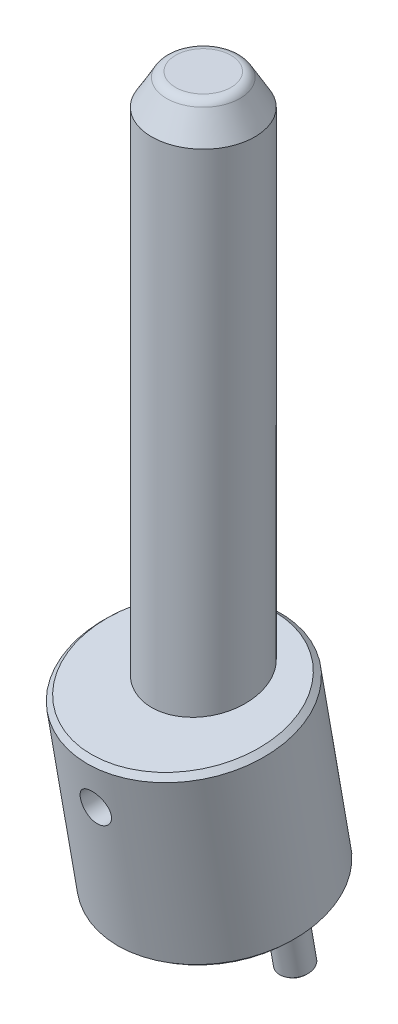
ISO-10303-21;
HEADER;
FILE_DESCRIPTION(('STEP AP214'),'2;1');
FILE_NAME('part.step','',(''),(''),'','','');
FILE_SCHEMA(('AUTOMOTIVE_DESIGN { 1 0 10303 214 1 1 1 1 }'));
ENDSEC;
DATA;
#1=APPLICATION_CONTEXT('core data for automotive mechanical design processes');
#2=APPLICATION_PROTOCOL_DEFINITION('international standard','automotive_design',2000,#1);
#3=PRODUCT_CONTEXT('',#1,'mechanical');
#4=PRODUCT('Part','Part','',(#3));
#5=PRODUCT_RELATED_PRODUCT_CATEGORY('part','',(#4));
#6=PRODUCT_DEFINITION_FORMATION('','',#4);
#7=PRODUCT_DEFINITION_CONTEXT('part definition',#1,'design');
#8=PRODUCT_DEFINITION('design','',#6,#7);
#9=PRODUCT_DEFINITION_SHAPE('','',#8);
#10=(LENGTH_UNIT() NAMED_UNIT(*) SI_UNIT(.MILLI.,.METRE.));
#11=(NAMED_UNIT(*) PLANE_ANGLE_UNIT() SI_UNIT($,.RADIAN.));
#12=(NAMED_UNIT(*) SI_UNIT($,.STERADIAN.) SOLID_ANGLE_UNIT());
#13=UNCERTAINTY_MEASURE_WITH_UNIT(LENGTH_MEASURE(1.E-05),#10,'distance_accuracy_value','');
#14=(GEOMETRIC_REPRESENTATION_CONTEXT(3) GLOBAL_UNCERTAINTY_ASSIGNED_CONTEXT((#13)) GLOBAL_UNIT_ASSIGNED_CONTEXT((#10,
#11,#12)) REPRESENTATION_CONTEXT('',''));
#15=CARTESIAN_POINT('',(0.,0.,0.));
#16=DIRECTION('',(0.,0.,1.));
#17=DIRECTION('',(1.,0.,0.));
#18=AXIS2_PLACEMENT_3D('',#15,#16,#17);
#19=CARTESIAN_POINT('',(0.,130.,0.));
#20=DIRECTION('',(0.,1.,0.));
#21=DIRECTION('',(-1.,0.,0.));
#22=AXIS2_PLACEMENT_3D('',#19,#20,#21);
#23=PLANE('',#22);
#24=CARTESIAN_POINT('',(0.,130.,0.));
#25=DIRECTION('',(0.,-1.,0.));
#26=DIRECTION('',(0.,0.,-1.));
#27=AXIS2_PLACEMENT_3D('',#24,#25,#26);
#28=CIRCLE('',#27,5.381197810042);
#29=CARTESIAN_POINT('',(0.,130.,-5.3811978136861));
#30=VERTEX_POINT('',#29);
#31=CARTESIAN_POINT('',(0.,130.,5.3811978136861));
#32=VERTEX_POINT('',#31);
#33=EDGE_CURVE('P0_E38',#30,#32,#28,.T.);
#34=ORIENTED_EDGE('',*,*,#33,.F.);
#35=CARTESIAN_POINT('',(0.,130.,0.));
#36=DIRECTION('',(0.,-1.,0.));
#37=DIRECTION('',(0.,0.,1.));
#38=AXIS2_PLACEMENT_3D('',#35,#36,#37);
#39=CIRCLE('',#38,5.381197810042);
#40=EDGE_CURVE('P0_E42',#32,#30,#39,.T.);
#41=ORIENTED_EDGE('',*,*,#40,.F.);
#42=EDGE_LOOP('',(#34,#41));
#43=FACE_BOUND('',#42,.T.);
#44=ADVANCED_FACE('P0_F17',(#43),#23,.T.);
#45=CARTESIAN_POINT('',(0.,128.,0.));
#46=DIRECTION('',(0.,1.,0.));
#47=DIRECTION('',(0.00894115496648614,0.,0.999960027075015));
#48=AXIS2_PLACEMENT_3D('',#45,#46,#47);
#49=TOROIDAL_SURFACE('',#48,5.381197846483,2.);
#50=ORIENTED_EDGE('',*,*,#33,.T.);
#51=ORIENTED_EDGE('',*,*,#40,.T.);
#52=EDGE_LOOP('',(#50,#51));
#53=FACE_BOUND('',#52,.T.);
#54=CARTESIAN_POINT('',(0.,129.000000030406,0.));
#55=DIRECTION('',(0.,-1.,0.));
#56=DIRECTION('',(0.,0.,1.));
#57=AXIS2_PLACEMENT_3D('',#54,#55,#56);
#58=CIRCLE('',#57,7.11324863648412);
#59=CARTESIAN_POINT('',(0.,129.000000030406,7.11324863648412));
#60=VERTEX_POINT('',#59);
#61=EDGE_CURVE('P0_E48',#60,#60,#58,.T.);
#62=ORIENTED_EDGE('',*,*,#61,.F.);
#63=EDGE_LOOP('',(#62));
#64=FACE_BOUND('',#63,.T.);
#65=ADVANCED_FACE('P0_F40',(#53,#64),#49,.T.);
#66=CARTESIAN_POINT('',(0.,0.,0.));
#67=DIRECTION('',(0.,1.,0.));
#68=DIRECTION('',(-1.,0.,0.));
#69=AXIS2_PLACEMENT_3D('',#66,#67,#68);
#70=PLANE('',#69);
#71=CARTESIAN_POINT('',(0.,8.84840740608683E-07,0.));
#72=DIRECTION('',(0.,1.,0.));
#73=DIRECTION('',(-1.,0.,0.));
#74=AXIS2_PLACEMENT_3D('',#71,#72,#73);
#75=CIRCLE('',#74,8.99999856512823);
#76=CARTESIAN_POINT('',(-8.99999856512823,8.84840740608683E-07,0.));
#77=VERTEX_POINT('',#76);
#78=EDGE_CURVE('P0_E85',#77,#77,#75,.T.);
#79=ORIENTED_EDGE('',*,*,#78,.F.);
#80=EDGE_LOOP('',(#79));
#81=FACE_BOUND('',#80,.T.);
#82=ADVANCED_FACE('P0_F76',(#81),#70,.F.);
#83=CARTESIAN_POINT('',(0.,17.,3.73205080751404));
#84=DIRECTION('',(0.,0.,1.));
#85=DIRECTION('',(-1.,0.,0.));
#86=AXIS2_PLACEMENT_3D('',#83,#84,#85);
#87=CONICAL_SURFACE('',#86,2.99999999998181,1.04719755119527);
#88=CARTESIAN_POINT('',(0.,16.9999999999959,1.99999999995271));
#89=VERTEX_POINT('',#88);
#90=VERTEX_LOOP('',#89);
#91=FACE_BOUND('',#90,.T.);
#92=CARTESIAN_POINT('',(0.,17.,3.732050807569));
#93=DIRECTION('',(0.,0.,1.));
#94=DIRECTION('',(0.,-1.,0.));
#95=AXIS2_PLACEMENT_3D('',#92,#93,#94);
#96=CIRCLE('',#95,3.);
#97=CARTESIAN_POINT('',(0.,14.,3.732050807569));
#98=VERTEX_POINT('',#97);
#99=EDGE_CURVE('P0_E82',#98,#98,#96,.T.);
#100=ORIENTED_EDGE('',*,*,#99,.T.);
#101=EDGE_LOOP('',(#100));
#102=FACE_BOUND('',#101,.T.);
#103=ADVANCED_FACE('P0_F116',(#91,#102),#87,.F.);
#104=CARTESIAN_POINT('',(0.,123.999999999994,0.));
#105=DIRECTION('',(0.,-1.,0.));
#106=DIRECTION('',(1.,0.,0.));
#107=AXIS2_PLACEMENT_3D('',#104,#105,#106);
#108=CONICAL_SURFACE('',#107,9.9999999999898,0.5235987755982);
#109=CARTESIAN_POINT('',(0.,124.,0.));
#110=DIRECTION('',(0.,1.,0.));
#111=DIRECTION('',(-1.,0.,0.));
#112=AXIS2_PLACEMENT_3D('',#109,#110,#111);
#113=CIRCLE('',#112,10.);
#114=CARTESIAN_POINT('',(-10.,124.,0.));
#115=VERTEX_POINT('',#114);
#116=EDGE_CURVE('P0_E92',#115,#115,#113,.F.);
#117=ORIENTED_EDGE('',*,*,#116,.F.);
#118=EDGE_LOOP('',(#117));
#119=FACE_BOUND('',#118,.T.);
#120=ORIENTED_EDGE('',*,*,#61,.T.);
#121=EDGE_LOOP('',(#120));
#122=FACE_BOUND('',#121,.T.);
#123=ADVANCED_FACE('P0_F108',(#119,#122),#108,.T.);
#124=CARTESIAN_POINT('',(0.,1.00000159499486,0.));
#125=DIRECTION('',(0.,1.,0.));
#126=DIRECTION('',(-1.,0.,0.));
#127=AXIS2_PLACEMENT_3D('',#124,#125,#126);
#128=CONICAL_SURFACE('',#127,9.99999901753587,0.785398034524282);
#129=CARTESIAN_POINT('',(0.,1.000000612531,0.));
#130=DIRECTION('',(0.,1.,0.));
#131=DIRECTION('',(-1.,0.,0.));
#132=AXIS2_PLACEMENT_3D('',#129,#130,#131);
#133=CIRCLE('',#132,10.);
#134=CARTESIAN_POINT('',(-10.,1.000000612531,0.));
#135=VERTEX_POINT('',#134);
#136=EDGE_CURVE('P0_E28',#135,#135,#133,.T.);
#137=ORIENTED_EDGE('',*,*,#136,.F.);
#138=EDGE_LOOP('',(#137));
#139=FACE_BOUND('',#138,.T.);
#140=ORIENTED_EDGE('',*,*,#78,.T.);
#141=EDGE_LOOP('',(#140));
#142=FACE_BOUND('',#141,.T.);
#143=ADVANCED_FACE('P0_F105',(#139,#142),#128,.T.);
#144=CARTESIAN_POINT('',(0.,17.,1.5));
#145=DIRECTION('',(0.,0.,1.));
#146=DIRECTION('',(0.,-1.,0.));
#147=AXIS2_PLACEMENT_3D('',#144,#145,#146);
#148=CYLINDRICAL_SURFACE('',#147,3.);
#149=ORIENTED_EDGE('',*,*,#99,.F.);
#150=EDGE_LOOP('',(#149));
#151=FACE_BOUND('',#150,.T.);
#152=CARTESIAN_POINT('',(0.,14.,10.));
#153=CARTESIAN_POINT('',(-0.164364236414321,14.0000089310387,9.99999407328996));
#154=CARTESIAN_POINT('',(-0.328908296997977,14.0135695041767,9.99590322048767));
#155=CARTESIAN_POINT('',(-0.653366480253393,14.0673818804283,9.9799606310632));
#156=CARTESIAN_POINT('',(-0.813271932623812,14.1076806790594,9.96809523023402));
#157=CARTESIAN_POINT('',(-1.12348315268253,14.2135007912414,9.93790838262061));
#158=CARTESIAN_POINT('',(-1.27380789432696,14.2789703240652,9.91960019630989));
#159=CARTESIAN_POINT('',(-1.56129290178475,14.4330996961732,9.87843514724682));
#160=CARTESIAN_POINT('',(-1.69845550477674,14.5217554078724,9.85557909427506));
#161=CARTESIAN_POINT('',(-1.95973946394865,14.7224452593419,9.80701539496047));
#162=CARTESIAN_POINT('',(-2.08342924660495,14.8350271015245,9.78124907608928));
#163=CARTESIAN_POINT('',(-2.31049290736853,15.0792112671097,9.73011807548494));
#164=CARTESIAN_POINT('',(-2.41386225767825,15.2108178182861,9.70475348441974));
#165=CARTESIAN_POINT('',(-2.59960101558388,15.4929419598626,9.65668220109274));
#166=CARTESIAN_POINT('',(-2.68144668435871,15.6438178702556,9.63404799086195));
#167=CARTESIAN_POINT('',(-2.81842825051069,15.9579795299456,9.59487230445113));
#168=CARTESIAN_POINT('',(-2.87357072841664,16.1212622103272,9.57832932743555));
#169=CARTESIAN_POINT('',(-2.95403265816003,16.4507804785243,9.5538174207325));
#170=CARTESIAN_POINT('',(-2.98014390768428,16.6168053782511,9.54562139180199));
#171=CARTESIAN_POINT('',(-3.00427461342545,16.9510662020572,9.53805579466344));
#172=CARTESIAN_POINT('',(-3.00230085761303,17.1193015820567,9.53868409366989));
#173=CARTESIAN_POINT('',(-2.9709395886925,17.4467673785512,9.54849486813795));
#174=CARTESIAN_POINT('',(-2.94254427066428,17.6061036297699,9.55736772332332));
#175=CARTESIAN_POINT('',(-2.86074869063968,17.9176387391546,9.58216703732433));
#176=CARTESIAN_POINT('',(-2.80734582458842,18.0698368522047,9.59809423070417));
#177=CARTESIAN_POINT('',(-2.67631861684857,18.3652051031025,9.6354552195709));
#178=CARTESIAN_POINT('',(-2.59837186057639,18.5082226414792,9.65696160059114));
#179=CARTESIAN_POINT('',(-2.42069837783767,18.7794716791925,9.70302119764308));
#180=CARTESIAN_POINT('',(-2.32096766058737,18.9077004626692,9.7275749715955));
#181=CARTESIAN_POINT('',(-2.09764727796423,19.1513495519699,9.77821549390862));
#182=CARTESIAN_POINT('',(-1.97323765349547,19.2660150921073,9.80432352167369));
#183=CARTESIAN_POINT('',(-1.7065766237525,19.4730741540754,9.85423611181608));
#184=CARTESIAN_POINT('',(-1.56431758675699,19.5654580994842,9.87803968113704));
#185=CARTESIAN_POINT('',(-1.26458300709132,19.7257915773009,9.92088257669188));
#186=CARTESIAN_POINT('',(-1.10700242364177,19.7935547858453,9.93988525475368));
#187=CARTESIAN_POINT('',(-0.782158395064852,19.9012737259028,9.97069163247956));
#188=CARTESIAN_POINT('',(-0.61491570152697,19.9412868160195,9.9825101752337));
#189=CARTESIAN_POINT('',(-0.371824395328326,19.9778051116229,9.99335985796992));
#190=CARTESIAN_POINT('',(-0.297737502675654,19.9861188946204,9.99584304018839));
#191=CARTESIAN_POINT('',(-0.14911274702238,19.9972183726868,9.99916445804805));
#192=CARTESIAN_POINT('',(-0.0745748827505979,20.000004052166,10.0000026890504));
#193=CARTESIAN_POINT('',(0.164364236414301,19.9999910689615,9.99999407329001));
#194=CARTESIAN_POINT('',(0.328908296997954,19.9864304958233,9.99590322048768));
#195=CARTESIAN_POINT('',(0.653366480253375,19.9326181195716,9.97996063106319));
#196=CARTESIAN_POINT('',(0.813271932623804,19.8923193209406,9.96809523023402));
#197=CARTESIAN_POINT('',(1.12348315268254,19.7864992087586,9.93790838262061));
#198=CARTESIAN_POINT('',(1.27380789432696,19.7210296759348,9.91960019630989));
#199=CARTESIAN_POINT('',(1.56129290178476,19.5669003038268,9.87843514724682));
#200=CARTESIAN_POINT('',(1.69845550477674,19.4782445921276,9.85557909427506));
#201=CARTESIAN_POINT('',(1.95973946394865,19.2775547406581,9.80701539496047));
#202=CARTESIAN_POINT('',(2.08342924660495,19.1649728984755,9.78124907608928));
#203=CARTESIAN_POINT('',(2.31049290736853,18.9207887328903,9.73011807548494));
#204=CARTESIAN_POINT('',(2.41386225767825,18.7891821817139,9.70475348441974));
#205=CARTESIAN_POINT('',(2.59960101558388,18.5070580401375,9.65668220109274));
#206=CARTESIAN_POINT('',(2.68144668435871,18.3561821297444,9.63404799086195));
#207=CARTESIAN_POINT('',(2.81842825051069,18.0420204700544,9.59487230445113));
#208=CARTESIAN_POINT('',(2.87357072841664,17.8787377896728,9.57832932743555));
#209=CARTESIAN_POINT('',(2.95403265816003,17.5492195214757,9.5538174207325));
#210=CARTESIAN_POINT('',(2.98014390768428,17.3831946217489,9.54562139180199));
#211=CARTESIAN_POINT('',(3.00427461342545,17.0489337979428,9.53805579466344));
#212=CARTESIAN_POINT('',(3.00230085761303,16.8806984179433,9.53868409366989));
#213=CARTESIAN_POINT('',(2.9709395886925,16.5532326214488,9.54849486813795));
#214=CARTESIAN_POINT('',(2.94254427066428,16.3938963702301,9.55736772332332));
#215=CARTESIAN_POINT('',(2.86074869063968,16.0823612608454,9.58216703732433));
#216=CARTESIAN_POINT('',(2.80734582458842,15.9301631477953,9.59809423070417));
#217=CARTESIAN_POINT('',(2.67631861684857,15.6347948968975,9.6354552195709));
#218=CARTESIAN_POINT('',(2.59837186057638,15.4917773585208,9.65696160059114));
#219=CARTESIAN_POINT('',(2.42069837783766,15.2205283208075,9.70302119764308));
#220=CARTESIAN_POINT('',(2.32096766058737,15.0922995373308,9.7275749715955));
#221=CARTESIAN_POINT('',(2.09764727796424,14.8486504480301,9.77821549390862));
#222=CARTESIAN_POINT('',(1.97323765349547,14.7339849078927,9.80432352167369));
#223=CARTESIAN_POINT('',(1.7065766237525,14.5269258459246,9.85423611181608));
#224=CARTESIAN_POINT('',(1.56431758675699,14.4345419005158,9.87803968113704));
#225=CARTESIAN_POINT('',(1.26458300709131,14.2742084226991,9.92088257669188));
#226=CARTESIAN_POINT('',(1.10700242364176,14.2064452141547,9.93988525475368));
#227=CARTESIAN_POINT('',(0.782158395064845,14.0987262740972,9.97069163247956));
#228=CARTESIAN_POINT('',(0.614915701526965,14.0587131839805,9.9825101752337));
#229=CARTESIAN_POINT('',(0.371824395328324,14.0221948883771,9.99335985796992));
#230=CARTESIAN_POINT('',(0.297737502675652,14.0138811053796,9.9958430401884));
#231=CARTESIAN_POINT('',(0.149112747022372,14.0027816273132,9.99916445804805));
#232=CARTESIAN_POINT('',(0.0745748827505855,13.999995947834,10.0000026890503));
#233=CARTESIAN_POINT('',(0.,14.,10.));
#234=B_SPLINE_CURVE_WITH_KNOTS('',3,(#152,#153,#154,#155,#156,#157,#158,#159,#160,#161,#162,
#163,#164,#165,#166,#167,#168,#169,#170,#171,#172,#173,#174,#175,#176,#177,#178,#179,#180,#181,
#182,#183,#184,#185,#186,#187,#188,#189,#190,#191,#192,#193,#194,#195,#196,#197,#198,#199,#200,
#201,#202,#203,#204,#205,#206,#207,#208,#209,#210,#211,#212,#213,#214,#215,#216,#217,#218,#219,
#220,#221,#222,#223,#224,#225,#226,#227,#228,#229,#230,#231,#232,#233),.UNSPECIFIED.,.T.,.F.,(4,
2,2,2,2,2,2,2,2,2,2,2,2,2,2,2,2,2,2,2,2,2,2,2,2,2,2,2,2,2,2,2,2,2,2,2,2,2,2,2,4),(0.,
0.49280574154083,0.98647994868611,1.47914396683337,1.97172034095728,2.47709830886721,
2.98258875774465,3.49943124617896,4.01614630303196,4.51839363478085,5.02051957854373,
5.50451902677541,5.98856888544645,6.47926306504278,6.97004721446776,7.48124851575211,
7.99266913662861,8.507883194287,9.02202912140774,9.24562293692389,9.4692173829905,
9.96202312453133,10.4556973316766,10.9483613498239,11.4409377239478,11.9463156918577,
12.4518061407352,12.9686486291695,13.4853636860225,13.9876110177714,14.4897369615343,
14.9737364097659,15.457786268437,15.9484804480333,16.4392645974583,16.9504658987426,
17.4618865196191,17.9771005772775,18.4912465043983,18.7148403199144,18.938434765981),.UNSPECIFIED.);
#235=CARTESIAN_POINT('',(0.,14.,10.));
#236=VERTEX_POINT('',#235);
#237=EDGE_CURVE('P0_E11',#236,#236,#234,.T.);
#238=ORIENTED_EDGE('',*,*,#237,.F.);
#239=EDGE_LOOP('',(#238));
#240=FACE_BOUND('',#239,.T.);
#241=ADVANCED_FACE('P0_F107',(#151,#240),#148,.F.);
#242=CARTESIAN_POINT('',(0.,-6.5,0.));
#243=DIRECTION('',(0.,1.,0.));
#244=DIRECTION('',(-1.,0.,0.));
#245=AXIS2_PLACEMENT_3D('',#242,#243,#244);
#246=CYLINDRICAL_SURFACE('',#245,10.);
#247=ORIENTED_EDGE('',*,*,#116,.T.);
#248=EDGE_LOOP('',(#247));
#249=FACE_BOUND('',#248,.T.);
#250=ORIENTED_EDGE('',*,*,#136,.T.);
#251=EDGE_LOOP('',(#250));
#252=FACE_BOUND('',#251,.T.);
#253=ORIENTED_EDGE('',*,*,#237,.T.);
#254=EDGE_LOOP('',(#253));
#255=FACE_BOUND('',#254,.T.);
#256=ADVANCED_FACE('P0_F102',(#249,#252,#255),#246,.T.);
#257=CLOSED_SHELL('',(#44,#65,#82,#103,#123,#143,#241,#256));
#258=MANIFOLD_SOLID_BREP('P0_B1',#257);
#259=CARTESIAN_POINT('',(0.,-15.0109415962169,-3.87493698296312));
#260=DIRECTION('',(0.,-0.984807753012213,-0.173648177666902));
#261=DIRECTION('',(0.,0.173648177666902,-0.984807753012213));
#262=AXIS2_PLACEMENT_3D('',#259,#260,#261);
#263=PLANE('',#262);
#264=CARTESIAN_POINT('',(-14.,-15.0109415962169,-3.87493698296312));
#265=DIRECTION('',(0.,-0.984807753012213,-0.173648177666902));
#266=DIRECTION('',(0.,0.173648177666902,-0.984807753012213));
#267=AXIS2_PLACEMENT_3D('',#264,#265,#266);
#268=CIRCLE('',#267,2.49998893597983);
#269=CARTESIAN_POINT('',(-14.,-14.5768230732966,-6.33694546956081));
#270=VERTEX_POINT('',#269);
#271=EDGE_CURVE('P1_E17',#270,#270,#268,.F.);
#272=ORIENTED_EDGE('',*,*,#271,.F.);
#273=EDGE_LOOP('',(#272));
#274=FACE_BOUND('',#273,.T.);
#275=ADVANCED_FACE('P1_F14',(#274),#263,.T.);
#276=CARTESIAN_POINT('',(0.,-15.0109415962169,-3.87493698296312));
#277=DIRECTION('',(0.,-0.984807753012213,-0.173648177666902));
#278=DIRECTION('',(0.,0.173648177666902,-0.984807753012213));
#279=AXIS2_PLACEMENT_3D('',#276,#277,#278);
#280=PLANE('',#279);
#281=CARTESIAN_POINT('',(14.,-15.0109415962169,-3.87493698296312));
#282=DIRECTION('',(0.,-0.984807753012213,-0.173648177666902));
#283=DIRECTION('',(0.,0.173648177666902,-0.984807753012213));
#284=AXIS2_PLACEMENT_3D('',#281,#282,#283);
#285=CIRCLE('',#284,2.49998893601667);
#286=CARTESIAN_POINT('',(14.,-14.5768230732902,-6.33694546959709));
#287=VERTEX_POINT('',#286);
#288=EDGE_CURVE('P1_E114',#287,#287,#285,.F.);
#289=ORIENTED_EDGE('',*,*,#288,.F.);
#290=EDGE_LOOP('',(#289));
#291=FACE_BOUND('',#290,.T.);
#292=ADVANCED_FACE('P1_F104',(#291),#280,.T.);
#293=CARTESIAN_POINT('',(0.,5.01335084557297E-13,-3.84674930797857E-13));
#294=DIRECTION('',(0.,-1.,0.));
#295=DIRECTION('',(0.,0.,-1.));
#296=AXIS2_PLACEMENT_3D('',#293,#294,#295);
#297=PLANE('',#296);
#298=CARTESIAN_POINT('',(0.,-4.81385764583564E-13,-2.32236105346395E-12));
#299=DIRECTION('',(0.,-1.,0.));
#300=DIRECTION('',(0.,0.,-1.));
#301=AXIS2_PLACEMENT_3D('',#298,#299,#300);
#302=CIRCLE('',#301,10.);
#303=CARTESIAN_POINT('',(0.,-4.81385764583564E-13,-10.0000000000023));
#304=VERTEX_POINT('',#303);
#305=EDGE_CURVE('P1_E116',#304,#304,#302,.F.);
#306=ORIENTED_EDGE('',*,*,#305,.T.);
#307=EDGE_LOOP('',(#306));
#308=FACE_BOUND('',#307,.T.);
#309=ADVANCED_FACE('P1_F101',(#308),#297,.F.);
#310=CARTESIAN_POINT('',(-14.,-14.5185292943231,-3.78811140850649));
#311=DIRECTION('',(0.,0.984807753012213,0.173648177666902));
#312=DIRECTION('',(0.,-0.173648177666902,0.984807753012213));
#313=AXIS2_PLACEMENT_3D('',#310,#311,#312);
#314=CONICAL_SURFACE('',#313,2.99999527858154,0.785395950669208);
#315=CARTESIAN_POINT('',(-14.,-14.518524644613,-3.78811058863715));
#316=DIRECTION('',(0.,0.984807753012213,0.173648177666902));
#317=DIRECTION('',(0.,-0.173648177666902,0.984807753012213));
#318=AXIS2_PLACEMENT_3D('',#315,#316,#317);
#319=CIRCLE('',#318,3.);
#320=CARTESIAN_POINT('',(-14.,-15.0394691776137,-0.833687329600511));
#321=VERTEX_POINT('',#320);
#322=EDGE_CURVE('P1_E118',#321,#321,#319,.T.);
#323=ORIENTED_EDGE('',*,*,#322,.F.);
#324=EDGE_LOOP('',(#323));
#325=FACE_BOUND('',#324,.T.);
#326=ORIENTED_EDGE('',*,*,#271,.T.);
#327=EDGE_LOOP('',(#326));
#328=FACE_BOUND('',#327,.T.);
#329=ADVANCED_FACE('P1_F97',(#325,#328),#314,.T.);
#330=CARTESIAN_POINT('',(14.,-14.5185292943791,-3.78811140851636));
#331=DIRECTION('',(0.,0.984807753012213,0.173648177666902));
#332=DIRECTION('',(0.,-0.173648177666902,0.984807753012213));
#333=AXIS2_PLACEMENT_3D('',#330,#331,#332);
#334=CONICAL_SURFACE('',#333,2.99999527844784,0.785395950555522);
#335=CARTESIAN_POINT('',(14.,-14.5185246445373,-3.7881105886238));
#336=DIRECTION('',(0.,0.984807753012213,0.173648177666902));
#337=DIRECTION('',(0.,-0.173648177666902,0.984807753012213));
#338=AXIS2_PLACEMENT_3D('',#335,#336,#337);
#339=CIRCLE('',#338,3.);
#340=CARTESIAN_POINT('',(14.,-15.039469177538,-0.833687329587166));
#341=VERTEX_POINT('',#340);
#342=EDGE_CURVE('P1_E123',#341,#341,#339,.T.);
#343=ORIENTED_EDGE('',*,*,#342,.F.);
#344=EDGE_LOOP('',(#343));
#345=FACE_BOUND('',#344,.T.);
#346=ORIENTED_EDGE('',*,*,#288,.T.);
#347=EDGE_LOOP('',(#346));
#348=FACE_BOUND('',#347,.T.);
#349=ADVANCED_FACE('P1_F92',(#345,#348),#334,.T.);
#350=CARTESIAN_POINT('',(0.,43.881110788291,-2.32322841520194E-12));
#351=DIRECTION('',(0.,-1.,0.));
#352=DIRECTION('',(0.,0.,-1.));
#353=AXIS2_PLACEMENT_3D('',#350,#351,#352);
#354=CYLINDRICAL_SURFACE('',#353,10.);
#355=CARTESIAN_POINT('',(0.,30.0000000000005,-2.32322841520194E-12));
#356=DIRECTION('',(0.,0.984807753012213,0.173648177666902));
#357=DIRECTION('',(0.,-0.173648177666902,0.984807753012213));
#358=AXIS2_PLACEMENT_3D('',#355,#356,#357);
#359=ELLIPSE('',#358,10.1542661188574,10.);
#360=CARTESIAN_POINT('',(0.,28.2367301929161,9.99999999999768));
#361=VERTEX_POINT('',#360);
#362=EDGE_CURVE('P1_E79',#361,#361,#359,.F.);
#363=ORIENTED_EDGE('',*,*,#362,.F.);
#364=EDGE_LOOP('',(#363));
#365=FACE_BOUND('',#364,.T.);
#366=ORIENTED_EDGE('',*,*,#305,.F.);
#367=EDGE_LOOP('',(#366));
#368=FACE_BOUND('',#367,.T.);
#369=CARTESIAN_POINT('',(0.,20.0000000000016,9.99999999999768));
#370=CARTESIAN_POINT('',(-0.16436423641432,19.9999910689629,9.99999407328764));
#371=CARTESIAN_POINT('',(-0.328908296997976,19.9864304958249,9.99590322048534));
#372=CARTESIAN_POINT('',(-0.653366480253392,19.9326181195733,9.97996063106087));
#373=CARTESIAN_POINT('',(-0.813271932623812,19.8923193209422,9.9680952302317));
#374=CARTESIAN_POINT('',(-1.12348315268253,19.7864992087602,9.93790838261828));
#375=CARTESIAN_POINT('',(-1.27380789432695,19.7210296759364,9.91960019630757));
#376=CARTESIAN_POINT('',(-1.56129290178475,19.5669003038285,9.8784351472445));
#377=CARTESIAN_POINT('',(-1.69845550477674,19.4782445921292,9.85557909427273));
#378=CARTESIAN_POINT('',(-1.95973946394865,19.2775547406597,9.80701539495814));
#379=CARTESIAN_POINT('',(-2.08342924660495,19.1649728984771,9.78124907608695));
#380=CARTESIAN_POINT('',(-2.31049290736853,18.9207887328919,9.73011807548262));
#381=CARTESIAN_POINT('',(-2.41386225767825,18.7891821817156,9.70475348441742));
#382=CARTESIAN_POINT('',(-2.59960101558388,18.5070580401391,9.65668220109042));
#383=CARTESIAN_POINT('',(-2.6814466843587,18.356182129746,9.63404799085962));
#384=CARTESIAN_POINT('',(-2.81842825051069,18.042020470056,9.59487230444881));
#385=CARTESIAN_POINT('',(-2.87357072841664,17.8787377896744,9.57832932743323));
#386=CARTESIAN_POINT('',(-2.95403265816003,17.5492195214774,9.55381742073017));
#387=CARTESIAN_POINT('',(-2.98014390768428,17.3831946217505,9.54562139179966));
#388=CARTESIAN_POINT('',(-3.00427461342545,17.0489337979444,9.53805579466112));
#389=CARTESIAN_POINT('',(-3.00230085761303,16.880698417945,9.53868409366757));
#390=CARTESIAN_POINT('',(-2.9709395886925,16.5532326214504,9.54849486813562));
#391=CARTESIAN_POINT('',(-2.94254427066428,16.3938963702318,9.557367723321));
#392=CARTESIAN_POINT('',(-2.86074869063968,16.0823612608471,9.58216703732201));
#393=CARTESIAN_POINT('',(-2.80734582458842,15.930163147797,9.59809423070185));
#394=CARTESIAN_POINT('',(-2.67631861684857,15.6347948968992,9.63545521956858));
#395=CARTESIAN_POINT('',(-2.59837186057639,15.4917773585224,9.65696160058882));
#396=CARTESIAN_POINT('',(-2.42069837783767,15.2205283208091,9.70302119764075));
#397=CARTESIAN_POINT('',(-2.32096766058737,15.0922995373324,9.72757497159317));
#398=CARTESIAN_POINT('',(-2.09764727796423,14.8486504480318,9.77821549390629));
#399=CARTESIAN_POINT('',(-1.97323765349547,14.7339849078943,9.80432352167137));
#400=CARTESIAN_POINT('',(-1.7065766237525,14.5269258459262,9.85423611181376));
#401=CARTESIAN_POINT('',(-1.56431758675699,14.4345419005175,9.87803968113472));
#402=CARTESIAN_POINT('',(-1.26458300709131,14.2742084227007,9.92088257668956));
#403=CARTESIAN_POINT('',(-1.10700242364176,14.2064452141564,9.93988525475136));
#404=CARTESIAN_POINT('',(-0.78215839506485,14.0987262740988,9.97069163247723));
#405=CARTESIAN_POINT('',(-0.614915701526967,14.0587131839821,9.98251017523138));
#406=CARTESIAN_POINT('',(-0.371824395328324,14.0221948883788,9.9933598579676));
#407=CARTESIAN_POINT('',(-0.297737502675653,14.0138811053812,9.99584304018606));
#408=CARTESIAN_POINT('',(-0.149112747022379,14.0027816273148,9.99916445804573));
#409=CARTESIAN_POINT('',(-0.0745748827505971,13.9999959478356,10.000002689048));
#410=CARTESIAN_POINT('',(0.164364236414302,14.0000089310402,9.99999407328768));
#411=CARTESIAN_POINT('',(0.328908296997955,14.0135695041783,9.99590322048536));
#412=CARTESIAN_POINT('',(0.653366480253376,14.06738188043,9.97996063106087));
#413=CARTESIAN_POINT('',(0.813271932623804,14.1076806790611,9.9680952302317));
#414=CARTESIAN_POINT('',(1.12348315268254,14.213500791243,9.93790838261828));
#415=CARTESIAN_POINT('',(1.27380789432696,14.2789703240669,9.91960019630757));
#416=CARTESIAN_POINT('',(1.56129290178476,14.4330996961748,9.8784351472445));
#417=CARTESIAN_POINT('',(1.69845550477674,14.5217554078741,9.85557909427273));
#418=CARTESIAN_POINT('',(1.95973946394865,14.7224452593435,9.80701539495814));
#419=CARTESIAN_POINT('',(2.08342924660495,14.8350271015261,9.78124907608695));
#420=CARTESIAN_POINT('',(2.31049290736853,15.0792112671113,9.73011807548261));
#421=CARTESIAN_POINT('',(2.41386225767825,15.2108178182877,9.70475348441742));
#422=CARTESIAN_POINT('',(2.59960101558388,15.4929419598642,9.65668220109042));
#423=CARTESIAN_POINT('',(2.68144668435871,15.6438178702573,9.63404799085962));
#424=CARTESIAN_POINT('',(2.81842825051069,15.9579795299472,9.59487230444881));
#425=CARTESIAN_POINT('',(2.87357072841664,16.1212622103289,9.57832932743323));
#426=CARTESIAN_POINT('',(2.95403265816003,16.4507804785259,9.55381742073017));
#427=CARTESIAN_POINT('',(2.98014390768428,16.6168053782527,9.54562139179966));
#428=CARTESIAN_POINT('',(3.00427461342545,16.9510662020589,9.53805579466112));
#429=CARTESIAN_POINT('',(3.00230085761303,17.1193015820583,9.53868409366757));
#430=CARTESIAN_POINT('',(2.9709395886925,17.4467673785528,9.54849486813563));
#431=CARTESIAN_POINT('',(2.94254427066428,17.6061036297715,9.557367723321));
#432=CARTESIAN_POINT('',(2.86074869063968,17.9176387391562,9.58216703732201));
#433=CARTESIAN_POINT('',(2.80734582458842,18.0698368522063,9.59809423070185));
#434=CARTESIAN_POINT('',(2.67631861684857,18.3652051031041,9.63545521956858));
#435=CARTESIAN_POINT('',(2.59837186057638,18.5082226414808,9.65696160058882));
#436=CARTESIAN_POINT('',(2.42069837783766,18.7794716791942,9.70302119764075));
#437=CARTESIAN_POINT('',(2.32096766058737,18.9077004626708,9.72757497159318));
#438=CARTESIAN_POINT('',(2.09764727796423,19.1513495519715,9.7782154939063));
#439=CARTESIAN_POINT('',(1.97323765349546,19.2660150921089,9.80432352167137));
#440=CARTESIAN_POINT('',(1.70657662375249,19.473074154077,9.85423611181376));
#441=CARTESIAN_POINT('',(1.56431758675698,19.5654580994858,9.87803968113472));
#442=CARTESIAN_POINT('',(1.26458300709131,19.7257915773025,9.92088257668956));
#443=CARTESIAN_POINT('',(1.10700242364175,19.7935547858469,9.93988525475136));
#444=CARTESIAN_POINT('',(0.782158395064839,19.9012737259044,9.97069163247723));
#445=CARTESIAN_POINT('',(0.614915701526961,19.9412868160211,9.98251017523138));
#446=CARTESIAN_POINT('',(0.371824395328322,19.9778051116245,9.9933598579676));
#447=CARTESIAN_POINT('',(0.297737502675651,19.986118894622,9.99584304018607));
#448=CARTESIAN_POINT('',(0.149112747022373,19.9972183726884,9.99916445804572));
#449=CARTESIAN_POINT('',(0.0745748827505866,20.0000040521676,10.000002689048));
#450=CARTESIAN_POINT('',(0.,20.0000000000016,9.99999999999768));
#451=B_SPLINE_CURVE_WITH_KNOTS('',3,(#369,#370,#371,#372,#373,#374,#375,#376,#377,#378,#379,
#380,#381,#382,#383,#384,#385,#386,#387,#388,#389,#390,#391,#392,#393,#394,#395,#396,#397,#398,
#399,#400,#401,#402,#403,#404,#405,#406,#407,#408,#409,#410,#411,#412,#413,#414,#415,#416,#417,
#418,#419,#420,#421,#422,#423,#424,#425,#426,#427,#428,#429,#430,#431,#432,#433,#434,#435,#436,
#437,#438,#439,#440,#441,#442,#443,#444,#445,#446,#447,#448,#449,#450),.UNSPECIFIED.,.T.,.F.,(4,
2,2,2,2,2,2,2,2,2,2,2,2,2,2,2,2,2,2,2,2,2,2,2,2,2,2,2,2,2,2,2,2,2,2,2,2,2,2,2,4),(0.,
0.492805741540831,0.986479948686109,1.47914396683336,1.97172034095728,2.47709830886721,
2.98258875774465,3.49943124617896,4.01614630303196,4.51839363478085,5.02051957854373,
5.50451902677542,5.98856888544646,6.47926306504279,6.97004721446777,7.48124851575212,
7.99266913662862,8.507883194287,9.02202912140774,9.2456229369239,9.46921738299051,
9.96202312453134,10.4556973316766,10.9483613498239,11.4409377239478,11.9463156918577,
12.4518061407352,12.9686486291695,13.4853636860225,13.9876110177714,14.4897369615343,
14.9737364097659,15.457786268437,15.9484804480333,16.4392645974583,16.9504658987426,
17.4618865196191,17.9771005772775,18.4912465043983,18.7148403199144,18.938434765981),.UNSPECIFIED.);
#452=CARTESIAN_POINT('',(0.,20.0000000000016,9.99999999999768));
#453=VERTEX_POINT('',#452);
#454=EDGE_CURVE('P1_E76',#453,#453,#451,.T.);
#455=ORIENTED_EDGE('',*,*,#454,.T.);
#456=EDGE_LOOP('',(#455));
#457=FACE_BOUND('',#456,.T.);
#458=ADVANCED_FACE('P1_F86',(#365,#368,#457),#354,.F.);
#459=CARTESIAN_POINT('',(-14.,-6.147671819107,-2.312103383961));
#460=DIRECTION('',(0.,-0.984807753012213,-0.173648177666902));
#461=DIRECTION('',(0.,0.173648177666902,-0.984807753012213));
#462=AXIS2_PLACEMENT_3D('',#459,#460,#461);
#463=CYLINDRICAL_SURFACE('',#462,3.);
#464=CARTESIAN_POINT('',(-14.,-6.147671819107,-2.312103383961));
#465=DIRECTION('',(0.,-0.984807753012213,-0.173648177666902));
#466=DIRECTION('',(0.,0.173648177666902,-0.984807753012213));
#467=AXIS2_PLACEMENT_3D('',#464,#465,#466);
#468=CIRCLE('',#467,3.);
#469=CARTESIAN_POINT('',(-14.,-5.62672728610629,-5.26652664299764));
#470=VERTEX_POINT('',#469);
#471=EDGE_CURVE('P1_E72',#470,#470,#468,.T.);
#472=ORIENTED_EDGE('',*,*,#471,.T.);
#473=EDGE_LOOP('',(#472));
#474=FACE_BOUND('',#473,.T.);
#475=ORIENTED_EDGE('',*,*,#322,.T.);
#476=EDGE_LOOP('',(#475));
#477=FACE_BOUND('',#476,.T.);
#478=ADVANCED_FACE('P1_F91',(#474,#477),#463,.T.);
#479=CARTESIAN_POINT('',(14.,-6.147671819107,-2.312103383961));
#480=DIRECTION('',(0.,-0.984807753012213,-0.173648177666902));
#481=DIRECTION('',(0.,0.173648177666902,-0.984807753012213));
#482=AXIS2_PLACEMENT_3D('',#479,#480,#481);
#483=CYLINDRICAL_SURFACE('',#482,3.);
#484=CARTESIAN_POINT('',(14.,-6.147671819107,-2.312103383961));
#485=DIRECTION('',(0.,-0.984807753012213,-0.173648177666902));
#486=DIRECTION('',(0.,0.173648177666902,-0.984807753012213));
#487=AXIS2_PLACEMENT_3D('',#484,#485,#486);
#488=CIRCLE('',#487,3.);
#489=CARTESIAN_POINT('',(14.,-5.62672728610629,-5.26652664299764));
#490=VERTEX_POINT('',#489);
#491=EDGE_CURVE('P1_E68',#490,#490,#488,.T.);
#492=ORIENTED_EDGE('',*,*,#491,.T.);
#493=EDGE_LOOP('',(#492));
#494=FACE_BOUND('',#493,.T.);
#495=ORIENTED_EDGE('',*,*,#342,.T.);
#496=EDGE_LOOP('',(#495));
#497=FACE_BOUND('',#496,.T.);
#498=ADVANCED_FACE('P1_F139',(#494,#497),#483,.T.);
#499=CARTESIAN_POINT('',(0.,29.3054072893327,3.93923101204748));
#500=DIRECTION('',(0.,0.984807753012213,0.173648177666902));
#501=DIRECTION('',(0.,-0.173648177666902,0.984807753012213));
#502=AXIS2_PLACEMENT_3D('',#499,#500,#501);
#503=PLANE('',#502);
#504=ORIENTED_EDGE('',*,*,#362,.T.);
#505=EDGE_LOOP('',(#504));
#506=FACE_BOUND('',#505,.T.);
#507=CARTESIAN_POINT('',(0.,29.3054072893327,3.93923101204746));
#508=DIRECTION('',(0.,0.984807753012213,0.173648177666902));
#509=DIRECTION('',(0.,-0.173648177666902,0.984807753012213));
#510=AXIS2_PLACEMENT_3D('',#507,#508,#509);
#511=CIRCLE('',#510,17.9999935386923);
#512=CARTESIAN_POINT('',(0.,26.1797412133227,21.6657642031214));
#513=VERTEX_POINT('',#512);
#514=EDGE_CURVE('P1_E38',#513,#513,#511,.F.);
#515=ORIENTED_EDGE('',*,*,#514,.F.);
#516=EDGE_LOOP('',(#515));
#517=FACE_BOUND('',#516,.T.);
#518=ADVANCED_FACE('P1_F63',(#506,#517),#503,.T.);
#519=CARTESIAN_POINT('',(0.,17.0000000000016,-4.38513664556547));
#520=DIRECTION('',(0.,0.,1.));
#521=DIRECTION('',(0.,-1.,0.));
#522=AXIS2_PLACEMENT_3D('',#519,#520,#521);
#523=CYLINDRICAL_SURFACE('',#522,3.);
#524=ORIENTED_EDGE('',*,*,#454,.F.);
#525=EDGE_LOOP('',(#524));
#526=FACE_BOUND('',#525,.T.);
#527=CARTESIAN_POINT('',(0.,14.0000000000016,20.5335803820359));
#528=CARTESIAN_POINT('',(-0.168302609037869,14.0000075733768,20.5335785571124));
#529=CARTESIAN_POINT('',(-0.336810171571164,14.0142184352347,20.5337915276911));
#530=CARTESIAN_POINT('',(-0.669274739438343,14.0707335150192,20.5348222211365));
#531=CARTESIAN_POINT('',(-0.833222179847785,14.1130927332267,20.5356411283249));
#532=CARTESIAN_POINT('',(-1.15158233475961,14.22470353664,20.5384117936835));
#533=CARTESIAN_POINT('',(-1.30600173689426,14.2939360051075,20.5403627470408));
#534=CARTESIAN_POINT('',(-1.60093485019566,14.4572813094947,20.5461890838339));
#535=CARTESIAN_POINT('',(-1.74145455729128,14.5513833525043,20.5500636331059));
#536=CARTESIAN_POINT('',(-2.00450802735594,14.761638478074,20.5606776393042));
#537=CARTESIAN_POINT('',(-2.12706252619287,14.8777657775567,20.5674137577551));
#538=CARTESIAN_POINT('',(-2.35089087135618,15.1287478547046,20.5846997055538));
#539=CARTESIAN_POINT('',(-2.45216408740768,15.2636031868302,20.595249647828));
#540=CARTESIAN_POINT('',(-2.63022108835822,15.5474531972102,20.6208988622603));
#541=CARTESIAN_POINT('',(-2.70710246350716,15.6963883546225,20.6359795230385));
#542=CARTESIAN_POINT('',(-2.83490279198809,16.0044427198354,20.6711684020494));
#543=CARTESIAN_POINT('',(-2.88582248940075,16.1635616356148,20.6912764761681));
#544=CARTESIAN_POINT('',(-2.96058361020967,16.487536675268,20.7365824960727));
#545=CARTESIAN_POINT('',(-2.98439157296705,16.6523996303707,20.7617866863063));
#546=CARTESIAN_POINT('',(-3.00452162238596,16.9830201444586,20.8168216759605));
#547=CARTESIAN_POINT('',(-3.00084123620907,17.1487777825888,20.8466528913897));
#548=CARTESIAN_POINT('',(-2.96616831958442,17.4795573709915,20.9105762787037));
#549=CARTESIAN_POINT('',(-2.93470650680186,17.6445174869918,20.9447329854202));
#550=CARTESIAN_POINT('',(-2.8449855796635,17.9664323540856,21.0155141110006));
#551=CARTESIAN_POINT('',(-2.78672162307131,18.1233856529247,21.0521389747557));
#552=CARTESIAN_POINT('',(-2.64317643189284,18.4293043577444,21.127130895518));
#553=CARTESIAN_POINT('',(-2.55722258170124,18.5779495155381,21.1655184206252));
#554=CARTESIAN_POINT('',(-2.36107996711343,18.8586621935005,21.241011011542));
#555=CARTESIAN_POINT('',(-2.25089046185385,18.9907292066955,21.2781160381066));
#556=CARTESIAN_POINT('',(-2.00814772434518,19.2354505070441,21.3490718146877));
#557=CARTESIAN_POINT('',(-1.87544319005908,19.3479622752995,21.3828979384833));
#558=CARTESIAN_POINT('',(-1.59163092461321,19.5489139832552,21.4447346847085));
#559=CARTESIAN_POINT('',(-1.44051799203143,19.6373470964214,21.4727436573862));
#560=CARTESIAN_POINT('',(-1.12888993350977,19.7846613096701,21.5201181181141));
#561=CARTESIAN_POINT('',(-0.968803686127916,19.8443634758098,21.539721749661));
#562=CARTESIAN_POINT('',(-0.722605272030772,19.9129230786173,21.5624120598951));
#563=CARTESIAN_POINT('',(-0.639582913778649,19.9322716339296,21.5688543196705));
#564=CARTESIAN_POINT('',(-0.472063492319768,19.9638493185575,21.5793991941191));
#565=CARTESIAN_POINT('',(-0.387567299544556,19.9760825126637,21.5835031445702));
#566=CARTESIAN_POINT('',(-0.252420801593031,19.9897890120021,21.588106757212));
#567=CARTESIAN_POINT('',(-0.202022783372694,19.9936158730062,21.5893937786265));
#568=CARTESIAN_POINT('',(-0.101090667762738,19.99872275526,21.5911122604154));
#569=CARTESIAN_POINT('',(-0.0505565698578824,20.0000027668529,21.5915437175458));
#570=CARTESIAN_POINT('',(0.16262485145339,19.9999910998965,21.5915375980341));
#571=CARTESIAN_POINT('',(0.325482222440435,19.9867091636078,21.5870535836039));
#572=CARTESIAN_POINT('',(0.646650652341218,19.9340135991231,21.5694235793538));
#573=CARTESIAN_POINT('',(0.804951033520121,19.894543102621,21.5562587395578));
#574=CARTESIAN_POINT('',(1.11200883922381,19.7909880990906,21.5222475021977));
#575=CARTESIAN_POINT('',(1.26078687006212,19.7269589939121,21.5014183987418));
#576=CARTESIAN_POINT('',(1.54528376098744,19.5764330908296,21.4534875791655));
#577=CARTESIAN_POINT('',(1.6810067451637,19.489943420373,21.4263878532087));
#578=CARTESIAN_POINT('',(1.93986289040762,19.2943352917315,21.3667625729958));
#579=CARTESIAN_POINT('',(2.06254000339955,19.1846535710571,21.3341068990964));
#580=CARTESIAN_POINT('',(2.28802634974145,18.9472433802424,21.2658594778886));
#581=CARTESIAN_POINT('',(2.39082965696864,18.81950954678,21.2302668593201));
#582=CARTESIAN_POINT('',(2.57822041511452,18.5433153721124,21.1564908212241));
#583=CARTESIAN_POINT('',(2.66181709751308,18.3941937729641,21.1182621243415));
#584=CARTESIAN_POINT('',(2.80260348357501,18.0837303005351,21.0427470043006));
#585=CARTESIAN_POINT('',(2.85979065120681,17.9223872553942,21.0054606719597));
#586=CARTESIAN_POINT('',(2.94655388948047,17.5896865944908,20.9331773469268));
#587=CARTESIAN_POINT('',(2.9757790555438,17.4182296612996,20.8982144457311));
#588=CARTESIAN_POINT('',(3.00415775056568,17.0720312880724,20.8325790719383));
#589=CARTESIAN_POINT('',(3.00331512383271,16.897290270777,20.8019060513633));
#590=CARTESIAN_POINT('',(2.97148176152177,16.5533328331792,20.7464025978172));
#591=CARTESIAN_POINT('',(2.94110929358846,16.3840765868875,20.7214653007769));
#592=CARTESIAN_POINT('',(2.85164291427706,16.0525866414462,20.6770262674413));
#593=CARTESIAN_POINT('',(2.79255278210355,15.890352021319,20.6575238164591));
#594=CARTESIAN_POINT('',(2.64894259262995,15.5817743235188,20.6242036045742));
#595=CARTESIAN_POINT('',(2.56507439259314,15.4351411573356,20.6102593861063));
#596=CARTESIAN_POINT('',(2.37374242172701,15.1577943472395,20.586820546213));
#597=CARTESIAN_POINT('',(2.26628146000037,15.0270788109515,20.5773253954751));
#598=CARTESIAN_POINT('',(2.03176144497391,14.7864156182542,20.5619911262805));
#599=CARTESIAN_POINT('',(1.90486586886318,14.6763103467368,20.5561233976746));
#600=CARTESIAN_POINT('',(1.63437175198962,14.4787131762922,20.5469735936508));
#601=CARTESIAN_POINT('',(1.49076591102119,14.3912312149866,20.5436926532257));
#602=CARTESIAN_POINT('',(1.19038991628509,14.2411432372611,20.5388070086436));
#603=CARTESIAN_POINT('',(1.03357015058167,14.1786365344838,20.5372089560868));
#604=CARTESIAN_POINT('',(0.711876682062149,14.0808569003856,20.5349809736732));
#605=CARTESIAN_POINT('',(0.547019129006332,14.0455315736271,20.5343491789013));
#606=CARTESIAN_POINT('',(0.317466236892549,14.0161636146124,20.5338447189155));
#607=CARTESIAN_POINT('',(0.254132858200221,14.0101069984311,20.5337442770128));
#608=CARTESIAN_POINT('',(0.12720941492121,14.0020237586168,20.5336124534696));
#609=CARTESIAN_POINT('',(0.0636193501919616,13.9999971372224,20.5335810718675));
#610=CARTESIAN_POINT('',(0.,14.0000000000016,20.5335803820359));
#611=B_SPLINE_CURVE_WITH_KNOTS('',3,(#527,#528,#529,#530,#531,#532,#533,#534,#535,#536,#537,
#538,#539,#540,#541,#542,#543,#544,#545,#546,#547,#548,#549,#550,#551,#552,#553,#554,#555,#556,
#557,#558,#559,#560,#561,#562,#563,#564,#565,#566,#567,#568,#569,#570,#571,#572,#573,#574,#575,
#576,#577,#578,#579,#580,#581,#582,#583,#584,#585,#586,#587,#588,#589,#590,#591,#592,#593,#594,
#595,#596,#597,#598,#599,#600,#601,#602,#603,#604,#605,#606,#607,#608,#609,#610),.UNSPECIFIED.,
.T.,.F.,(4,2,2,2,2,2,2,2,2,2,2,2,2,2,2,2,2,2,2,2,2,2,2,2,2,2,2,2,2,2,2,2,2,2,2,2,2,2,2,2,2,4),
(0.,0.504668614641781,1.01032623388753,1.5156248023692,2.02070444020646,2.52519643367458,
3.0297033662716,3.53216557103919,4.03461337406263,4.53768061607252,5.04079311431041,
5.5525702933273,6.06443996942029,6.5898223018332,7.11522069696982,7.6443007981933,
8.17353074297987,8.68657546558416,8.94276882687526,9.19881568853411,9.35042582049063,
9.50203652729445,9.9897212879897,10.4784685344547,10.9661196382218,11.4536161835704,
11.9546931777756,12.4559193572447,12.9790198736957,13.5021706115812,14.0318036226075,
14.5613689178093,15.0800802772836,15.5987233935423,16.1047814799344,16.610779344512,
17.1127336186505,17.6149080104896,18.1190598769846,18.6222374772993,18.8130049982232,
19.0037726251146),.UNSPECIFIED.);
#612=CARTESIAN_POINT('',(0.,14.0000000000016,20.5335803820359));
#613=VERTEX_POINT('',#612);
#614=EDGE_CURVE('P1_E31',#613,#613,#611,.T.);
#615=ORIENTED_EDGE('',*,*,#614,.F.);
#616=EDGE_LOOP('',(#615));
#617=FACE_BOUND('',#616,.T.);
#618=ADVANCED_FACE('P1_F40',(#526,#617),#523,.F.);
#619=CARTESIAN_POINT('',(0.,-6.147671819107,-2.312103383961));
#620=DIRECTION('',(0.,0.984807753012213,0.173648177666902));
#621=DIRECTION('',(0.,-0.173648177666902,0.984807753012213));
#622=AXIS2_PLACEMENT_3D('',#619,#620,#621);
#623=PLANE('',#622);
#624=ORIENTED_EDGE('',*,*,#491,.F.);
#625=EDGE_LOOP('',(#624));
#626=FACE_BOUND('',#625,.T.);
#627=ORIENTED_EDGE('',*,*,#471,.F.);
#628=EDGE_LOOP('',(#627));
#629=FACE_BOUND('',#628,.T.);
#630=CARTESIAN_POINT('',(0.,-6.14767181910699,-2.31210338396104));
#631=DIRECTION('',(0.,0.984807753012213,0.173648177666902));
#632=DIRECTION('',(0.,-0.173648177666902,0.984807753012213));
#633=AXIS2_PLACEMENT_3D('',#630,#631,#632);
#634=CIRCLE('',#633,17.9999934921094);
#635=CARTESIAN_POINT('',(0.,-9.27333788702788,15.4144297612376));
#636=VERTEX_POINT('',#635);
#637=EDGE_CURVE('P1_E26',#636,#636,#634,.T.);
#638=ORIENTED_EDGE('',*,*,#637,.F.);
#639=EDGE_LOOP('',(#638));
#640=FACE_BOUND('',#639,.T.);
#641=ADVANCED_FACE('P1_F55',(#626,#629,#640),#623,.F.);
#642=CARTESIAN_POINT('',(0.,28.320595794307,3.76558217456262));
#643=DIRECTION('',(0.,-0.984807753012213,-0.173648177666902));
#644=DIRECTION('',(0.,0.173648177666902,-0.984807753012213));
#645=AXIS2_PLACEMENT_3D('',#642,#643,#644);
#646=CONICAL_SURFACE('',#645,18.9999969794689,0.785397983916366);
#647=ORIENTED_EDGE('',*,*,#514,.T.);
#648=EDGE_LOOP('',(#647));
#649=FACE_BOUND('',#648,.T.);
#650=CARTESIAN_POINT('',(0.,28.3205987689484,3.76558269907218));
#651=DIRECTION('',(0.,0.984807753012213,0.173648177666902));
#652=DIRECTION('',(0.,-0.173648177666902,0.984807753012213));
#653=AXIS2_PLACEMENT_3D('',#650,#651,#652);
#654=CIRCLE('',#653,19.);
#655=CARTESIAN_POINT('',(0.,25.0212833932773,22.4769300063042));
#656=VERTEX_POINT('',#655);
#657=EDGE_CURVE('P1_E21',#656,#656,#654,.F.);
#658=ORIENTED_EDGE('',*,*,#657,.F.);
#659=EDGE_LOOP('',(#658));
#660=FACE_BOUND('',#659,.T.);
#661=ADVANCED_FACE('P1_F52',(#649,#660),#646,.T.);
#662=CARTESIAN_POINT('',(0.,-5.16286021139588,-2.13845452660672));
#663=DIRECTION('',(0.,0.984807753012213,0.173648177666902));
#664=DIRECTION('',(0.,-0.173648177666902,0.984807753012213));
#665=AXIS2_PLACEMENT_3D('',#662,#663,#664);
#666=CONICAL_SURFACE('',#665,18.9999970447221,0.785397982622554);
#667=CARTESIAN_POINT('',(0.,-5.16286312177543,-2.13845503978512));
#668=DIRECTION('',(0.,0.984807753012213,0.173648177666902));
#669=DIRECTION('',(0.,-0.173648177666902,0.984807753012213));
#670=AXIS2_PLACEMENT_3D('',#667,#668,#669);
#671=CIRCLE('',#670,19.);
#672=CARTESIAN_POINT('',(0.,-8.46217849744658,16.5728922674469));
#673=VERTEX_POINT('',#672);
#674=EDGE_CURVE('P1_E9',#673,#673,#671,.T.);
#675=ORIENTED_EDGE('',*,*,#674,.F.);
#676=EDGE_LOOP('',(#675));
#677=FACE_BOUND('',#676,.T.);
#678=ORIENTED_EDGE('',*,*,#637,.T.);
#679=EDGE_LOOP('',(#678));
#680=FACE_BOUND('',#679,.T.);
#681=ADVANCED_FACE('P1_F48',(#677,#680),#666,.T.);
#682=CARTESIAN_POINT('',(0.,-7.92032577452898,-2.62467010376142));
#683=DIRECTION('',(0.,0.984807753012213,0.173648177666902));
#684=DIRECTION('',(0.,-0.173648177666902,0.984807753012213));
#685=AXIS2_PLACEMENT_3D('',#682,#683,#684);
#686=CYLINDRICAL_SURFACE('',#685,19.);
#687=ORIENTED_EDGE('',*,*,#657,.T.);
#688=EDGE_LOOP('',(#687));
#689=FACE_BOUND('',#688,.T.);
#690=ORIENTED_EDGE('',*,*,#674,.T.);
#691=EDGE_LOOP('',(#690));
#692=FACE_BOUND('',#691,.T.);
#693=ORIENTED_EDGE('',*,*,#614,.T.);
#694=EDGE_LOOP('',(#693));
#695=FACE_BOUND('',#694,.T.);
#696=ADVANCED_FACE('P1_F44',(#689,#692,#695),#686,.T.);
#697=CLOSED_SHELL('',(#275,#292,#309,#329,#349,#458,#478,#498,#518,#618,#641,#661,#681,#696));
#698=MANIFOLD_SOLID_BREP('P1_B1',#697);
#699=ADVANCED_BREP_SHAPE_REPRESENTATION('',(#18,#258,#698),#14);
#700=SHAPE_DEFINITION_REPRESENTATION(#9,#699);
ENDSEC;
END-ISO-10303-21;
